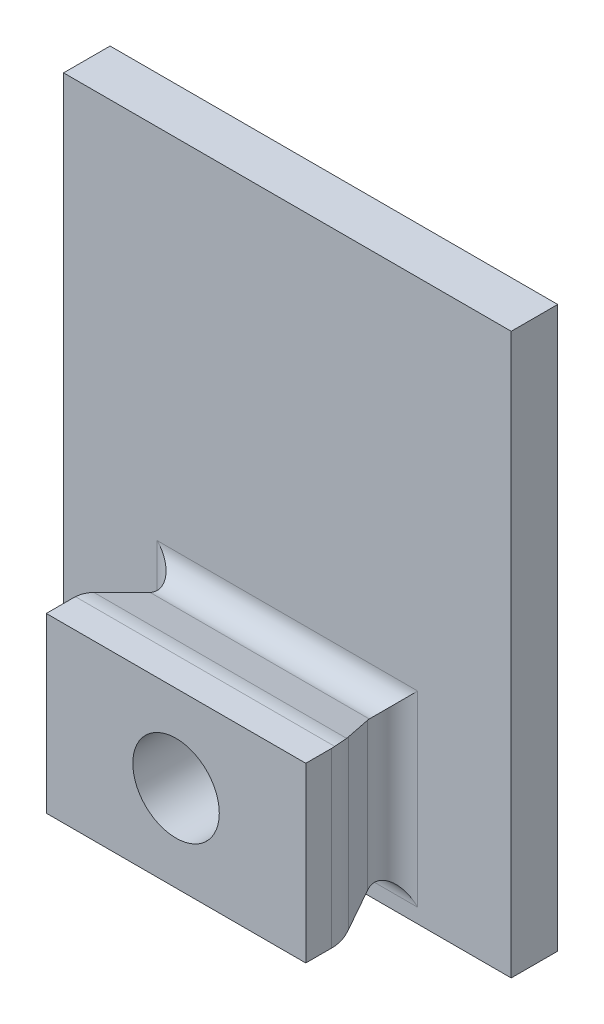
ISO-10303-21;
HEADER;
FILE_DESCRIPTION(('STEP AP214'),'2;1');
FILE_NAME('part.step','',(''),(''),'','','');
FILE_SCHEMA(('AUTOMOTIVE_DESIGN { 1 0 10303 214 1 1 1 1 }'));
ENDSEC;
DATA;
#1=APPLICATION_CONTEXT('core data for automotive mechanical design processes');
#2=APPLICATION_PROTOCOL_DEFINITION('international standard','automotive_design',2000,#1);
#3=PRODUCT_CONTEXT('',#1,'mechanical');
#4=PRODUCT('Part','Part','',(#3));
#5=PRODUCT_RELATED_PRODUCT_CATEGORY('part','',(#4));
#6=PRODUCT_DEFINITION_FORMATION('','',#4);
#7=PRODUCT_DEFINITION_CONTEXT('part definition',#1,'design');
#8=PRODUCT_DEFINITION('design','',#6,#7);
#9=PRODUCT_DEFINITION_SHAPE('','',#8);
#10=(LENGTH_UNIT() NAMED_UNIT(*) SI_UNIT(.MILLI.,.METRE.));
#11=(NAMED_UNIT(*) PLANE_ANGLE_UNIT() SI_UNIT($,.RADIAN.));
#12=(NAMED_UNIT(*) SI_UNIT($,.STERADIAN.) SOLID_ANGLE_UNIT());
#13=UNCERTAINTY_MEASURE_WITH_UNIT(LENGTH_MEASURE(1.E-05),#10,'distance_accuracy_value','');
#14=(GEOMETRIC_REPRESENTATION_CONTEXT(3) GLOBAL_UNCERTAINTY_ASSIGNED_CONTEXT((#13)) GLOBAL_UNIT_ASSIGNED_CONTEXT((#10,
#11,#12)) REPRESENTATION_CONTEXT('',''));
#15=CARTESIAN_POINT('',(0.,0.,0.));
#16=DIRECTION('',(0.,0.,1.));
#17=DIRECTION('',(1.,0.,0.));
#18=AXIS2_PLACEMENT_3D('',#15,#16,#17);
#19=CARTESIAN_POINT('',(-60.,40.,17.));
#20=DIRECTION('',(1.,0.,0.));
#21=DIRECTION('',(0.,1.,0.));
#22=AXIS2_PLACEMENT_3D('',#19,#20,#21);
#23=PLANE('',#22);
#24=DIRECTION('',(0.,0.,-1.));
#25=VECTOR('',#24,1.);
#26=CARTESIAN_POINT('',(-60.,40.,17.));
#27=LINE('',#26,#25);
#28=CARTESIAN_POINT('',(-60.,40.,17.));
#29=VERTEX_POINT('',#28);
#30=CARTESIAN_POINT('',(-60.,40.,5.19968101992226));
#31=VERTEX_POINT('',#30);
#32=EDGE_CURVE('E372',#29,#31,#27,.T.);
#33=ORIENTED_EDGE('',*,*,#32,.T.);
#34=DIRECTION('',(0.,-1.,0.));
#35=VECTOR('',#34,1.);
#36=CARTESIAN_POINT('',(-60.,-40.,5.19968101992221));
#37=LINE('',#36,#35);
#38=CARTESIAN_POINT('',(-60.,-40.,5.19968101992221));
#39=VERTEX_POINT('',#38);
#40=EDGE_CURVE('E359',#31,#39,#37,.T.);
#41=ORIENTED_EDGE('',*,*,#40,.T.);
#42=DIRECTION('',(0.,0.,-1.));
#43=VECTOR('',#42,1.);
#44=CARTESIAN_POINT('',(-60.,-40.,17.));
#45=LINE('',#44,#43);
#46=CARTESIAN_POINT('',(-60.,-40.,17.));
#47=VERTEX_POINT('',#46);
#48=EDGE_CURVE('E376',#47,#39,#45,.T.);
#49=ORIENTED_EDGE('',*,*,#48,.F.);
#50=DIRECTION('',(0.,-1.,0.));
#51=VECTOR('',#50,1.);
#52=CARTESIAN_POINT('',(-60.,40.,17.));
#53=LINE('',#52,#51);
#54=EDGE_CURVE('E235',#29,#47,#53,.T.);
#55=ORIENTED_EDGE('',*,*,#54,.F.);
#56=EDGE_LOOP('',(#33,#41,#49,#55));
#57=FACE_BOUND('',#56,.T.);
#58=ADVANCED_FACE('F43',(#57),#23,.F.);
#59=CARTESIAN_POINT('',(-60.,-40.,17.));
#60=DIRECTION('',(0.,1.,0.));
#61=DIRECTION('',(0.,0.,1.));
#62=AXIS2_PLACEMENT_3D('',#59,#60,#61);
#63=PLANE('',#62);
#64=ORIENTED_EDGE('',*,*,#48,.T.);
#65=CARTESIAN_POINT('',(-35.,-40.,5.19968101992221));
#66=DIRECTION('',(0.,1.,0.));
#67=DIRECTION('',(0.,0.,1.));
#68=AXIS2_PLACEMENT_3D('',#65,#66,#67);
#69=CIRCLE('',#68,25.);
#70=CARTESIAN_POINT('',(-59.9455199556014,-40.,3.55012527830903));
#71=VERTEX_POINT('',#70);
#72=EDGE_CURVE('E389',#39,#71,#69,.F.);
#73=ORIENTED_EDGE('',*,*,#72,.T.);
#74=DIRECTION('',(1.,0.,0.));
#75=VECTOR('',#74,1.);
#76=CARTESIAN_POINT('',(60.,-40.,3.55012527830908));
#77=LINE('',#76,#75);
#78=CARTESIAN_POINT('',(59.9455199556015,-40.,3.55012527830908));
#79=VERTEX_POINT('',#78);
#80=EDGE_CURVE('E386',#71,#79,#77,.T.);
#81=ORIENTED_EDGE('',*,*,#80,.T.);
#82=CARTESIAN_POINT('',(35.,-40.,5.19968101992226));
#83=DIRECTION('',(0.,1.,0.));
#84=DIRECTION('',(0.,0.,1.));
#85=AXIS2_PLACEMENT_3D('',#82,#83,#84);
#86=CIRCLE('',#85,25.);
#87=CARTESIAN_POINT('',(60.,-40.,5.19968101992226));
#88=VERTEX_POINT('',#87);
#89=EDGE_CURVE('E380',#79,#88,#86,.F.);
#90=ORIENTED_EDGE('',*,*,#89,.T.);
#91=DIRECTION('',(0.,0.,-1.));
#92=VECTOR('',#91,1.);
#93=CARTESIAN_POINT('',(60.,-40.,17.));
#94=LINE('',#93,#92);
#95=CARTESIAN_POINT('',(60.,-40.,17.));
#96=VERTEX_POINT('',#95);
#97=EDGE_CURVE('E373',#96,#88,#94,.T.);
#98=ORIENTED_EDGE('',*,*,#97,.F.);
#99=DIRECTION('',(1.,0.,0.));
#100=VECTOR('',#99,1.);
#101=CARTESIAN_POINT('',(-60.,-40.,17.));
#102=LINE('',#101,#100);
#103=EDGE_CURVE('E366',#47,#96,#102,.T.);
#104=ORIENTED_EDGE('',*,*,#103,.F.);
#105=EDGE_LOOP('',(#64,#73,#81,#90,#98,#104));
#106=FACE_BOUND('',#105,.T.);
#107=ADVANCED_FACE('F407',(#106),#63,.F.);
#108=CARTESIAN_POINT('',(60.,40.,17.));
#109=DIRECTION('',(-1.,0.,0.));
#110=DIRECTION('',(0.,-1.,0.));
#111=AXIS2_PLACEMENT_3D('',#108,#109,#110);
#112=PLANE('',#111);
#113=ORIENTED_EDGE('',*,*,#97,.T.);
#114=DIRECTION('',(0.,1.,0.));
#115=VECTOR('',#114,1.);
#116=CARTESIAN_POINT('',(60.,40.,5.19968101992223));
#117=LINE('',#116,#115);
#118=CARTESIAN_POINT('',(60.,40.,5.19968101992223));
#119=VERTEX_POINT('',#118);
#120=EDGE_CURVE('E251',#88,#119,#117,.T.);
#121=ORIENTED_EDGE('',*,*,#120,.T.);
#122=DIRECTION('',(0.,0.,-1.));
#123=VECTOR('',#122,1.);
#124=CARTESIAN_POINT('',(60.,40.,17.));
#125=LINE('',#124,#123);
#126=CARTESIAN_POINT('',(60.,40.,17.));
#127=VERTEX_POINT('',#126);
#128=EDGE_CURVE('E377',#127,#119,#125,.T.);
#129=ORIENTED_EDGE('',*,*,#128,.F.);
#130=DIRECTION('',(0.,1.,0.));
#131=VECTOR('',#130,1.);
#132=CARTESIAN_POINT('',(60.,40.,17.));
#133=LINE('',#132,#131);
#134=EDGE_CURVE('E368',#96,#127,#133,.T.);
#135=ORIENTED_EDGE('',*,*,#134,.F.);
#136=EDGE_LOOP('',(#113,#121,#129,#135));
#137=FACE_BOUND('',#136,.T.);
#138=ADVANCED_FACE('F418',(#137),#112,.F.);
#139=CARTESIAN_POINT('',(-60.,40.,17.));
#140=DIRECTION('',(0.,-1.,0.));
#141=DIRECTION('',(0.,0.,-1.));
#142=AXIS2_PLACEMENT_3D('',#139,#140,#141);
#143=PLANE('',#142);
#144=DIRECTION('',(-1.,0.,0.));
#145=VECTOR('',#144,1.);
#146=CARTESIAN_POINT('',(-60.,40.,3.55012527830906));
#147=LINE('',#146,#145);
#148=CARTESIAN_POINT('',(59.9455199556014,40.,3.55012527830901));
#149=VERTEX_POINT('',#148);
#150=CARTESIAN_POINT('',(-59.9455199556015,40.,3.55012527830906));
#151=VERTEX_POINT('',#150);
#152=EDGE_CURVE('E247',#149,#151,#147,.T.);
#153=ORIENTED_EDGE('',*,*,#152,.T.);
#154=CARTESIAN_POINT('',(-35.,40.,5.19968101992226));
#155=DIRECTION('',(0.,-1.,0.));
#156=DIRECTION('',(0.,0.,-1.));
#157=AXIS2_PLACEMENT_3D('',#154,#155,#156);
#158=CIRCLE('',#157,25.);
#159=EDGE_CURVE('E249',#151,#31,#158,.F.);
#160=ORIENTED_EDGE('',*,*,#159,.T.);
#161=ORIENTED_EDGE('',*,*,#32,.F.);
#162=DIRECTION('',(-1.,0.,0.));
#163=VECTOR('',#162,1.);
#164=CARTESIAN_POINT('',(-60.,40.,17.));
#165=LINE('',#164,#163);
#166=EDGE_CURVE('E370',#127,#29,#165,.T.);
#167=ORIENTED_EDGE('',*,*,#166,.F.);
#168=ORIENTED_EDGE('',*,*,#128,.T.);
#169=CARTESIAN_POINT('',(35.,40.,5.19968101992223));
#170=DIRECTION('',(0.,-1.,0.));
#171=DIRECTION('',(0.,0.,-1.));
#172=AXIS2_PLACEMENT_3D('',#169,#170,#171);
#173=CIRCLE('',#172,25.);
#174=EDGE_CURVE('E245',#119,#149,#173,.F.);
#175=ORIENTED_EDGE('',*,*,#174,.T.);
#176=EDGE_LOOP('',(#153,#160,#161,#167,#168,#175));
#177=FACE_BOUND('',#176,.T.);
#178=ADVANCED_FACE('F426',(#177),#143,.F.);
#179=CARTESIAN_POINT('',(0.,0.,17.));
#180=DIRECTION('',(0.,0.,1.));
#181=DIRECTION('',(1.,0.,0.));
#182=AXIS2_PLACEMENT_3D('',#179,#180,#181);
#183=PLANE('',#182);
#184=CARTESIAN_POINT('',(0.,0.,17.));
#185=DIRECTION('',(0.,0.,1.));
#186=DIRECTION('',(1.,0.,0.));
#187=AXIS2_PLACEMENT_3D('',#184,#185,#186);
#188=CIRCLE('',#187,20.);
#189=CARTESIAN_POINT('',(20.,0.,17.));
#190=VERTEX_POINT('',#189);
#191=EDGE_CURVE('E210',#190,#190,#188,.T.);
#192=ORIENTED_EDGE('',*,*,#191,.F.);
#193=EDGE_LOOP('',(#192));
#194=FACE_BOUND('',#193,.T.);
#195=ORIENTED_EDGE('',*,*,#54,.T.);
#196=ORIENTED_EDGE('',*,*,#103,.T.);
#197=ORIENTED_EDGE('',*,*,#134,.T.);
#198=ORIENTED_EDGE('',*,*,#166,.T.);
#199=EDGE_LOOP('',(#195,#196,#197,#198));
#200=FACE_BOUND('',#199,.T.);
#201=ADVANCED_FACE('F432',(#194,#200),#183,.T.);
#202=CARTESIAN_POINT('',(50.4610492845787,0.,-21.939586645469));
#203=DIRECTION('',(0.917070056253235,0.,-0.39872611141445));
#204=DIRECTION('',(-0.39872611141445,0.,-0.917070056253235));
#205=AXIS2_PLACEMENT_3D('',#202,#203,#204);
#206=PLANE('',#205);
#207=DIRECTION('',(-0.385344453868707,0.256896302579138,-0.886292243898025));
#208=VECTOR('',#207,1.);
#209=CARTESIAN_POINT('',(60.,-40.,0.));
#210=LINE('',#209,#208);
#211=CARTESIAN_POINT('',(57.9267514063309,-38.6178342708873,-4.76847176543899));
#212=VERTEX_POINT('',#211);
#213=CARTESIAN_POINT('',(51.081417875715,-34.05427858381,-20.5127388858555));
#214=VERTEX_POINT('',#213);
#215=EDGE_CURVE('E236',#212,#214,#210,.T.);
#216=ORIENTED_EDGE('',*,*,#215,.T.);
#217=DIRECTION('',(0.,1.,0.));
#218=VECTOR('',#217,1.);
#219=CARTESIAN_POINT('',(51.081417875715,30.,-20.5127388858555));
#220=LINE('',#219,#218);
#221=CARTESIAN_POINT('',(51.081417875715,34.05427858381,-20.5127388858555));
#222=VERTEX_POINT('',#221);
#223=EDGE_CURVE('E310',#214,#222,#220,.T.);
#224=ORIENTED_EDGE('',*,*,#223,.T.);
#225=DIRECTION('',(-0.385344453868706,-0.256896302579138,-0.886292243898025));
#226=VECTOR('',#225,1.);
#227=CARTESIAN_POINT('',(60.,40.,0.));
#228=LINE('',#227,#226);
#229=CARTESIAN_POINT('',(57.9267514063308,38.6178342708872,-4.76847176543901));
#230=VERTEX_POINT('',#229);
#231=EDGE_CURVE('E231',#230,#222,#228,.T.);
#232=ORIENTED_EDGE('',*,*,#231,.F.);
#233=DIRECTION('',(0.,1.,0.));
#234=VECTOR('',#233,1.);
#235=CARTESIAN_POINT('',(57.9267514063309,-40.,-4.76847176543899));
#236=LINE('',#235,#234);
#237=EDGE_CURVE('E253',#230,#212,#236,.F.);
#238=ORIENTED_EDGE('',*,*,#237,.T.);
#239=EDGE_LOOP('',(#216,#224,#232,#238));
#240=FACE_BOUND('',#239,.T.);
#241=ADVANCED_FACE('F434',(#240),#206,.T.);
#242=CARTESIAN_POINT('',(0.,36.8998256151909,-10.6956016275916));
#243=DIRECTION('',(0.,0.960466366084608,-0.278396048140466));
#244=DIRECTION('',(0.,0.278396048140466,0.960466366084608));
#245=AXIS2_PLACEMENT_3D('',#242,#243,#244);
#246=PLANE('',#245);
#247=ORIENTED_EDGE('',*,*,#231,.T.);
#248=CARTESIAN_POINT('',(60.2521184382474,32.8985507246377,-24.5));
#249=DIRECTION('',(0.,0.960466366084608,-0.278396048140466));
#250=DIRECTION('',(0.,-0.278396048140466,-0.960466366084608));
#251=AXIS2_PLACEMENT_3D('',#248,#249,#250);
#252=ELLIPSE('',#251,10.4116087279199,10.);
#253=CARTESIAN_POINT('',(50.6474547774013,33.7054957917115,-21.7160395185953));
#254=VERTEX_POINT('',#253);
#255=EDGE_CURVE('E52',#222,#254,#252,.F.);
#256=ORIENTED_EDGE('',*,*,#255,.T.);
#257=DIRECTION('',(-1.,0.,0.));
#258=VECTOR('',#257,1.);
#259=CARTESIAN_POINT('',(-45.,33.7054957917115,-21.7160395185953));
#260=LINE('',#259,#258);
#261=CARTESIAN_POINT('',(-50.6474547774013,33.7054957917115,-21.7160395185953));
#262=VERTEX_POINT('',#261);
#263=EDGE_CURVE('E255',#254,#262,#260,.T.);
#264=ORIENTED_EDGE('',*,*,#263,.T.);
#265=CARTESIAN_POINT('',(-60.2521184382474,32.8985507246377,-24.5));
#266=DIRECTION('',(0.,0.960466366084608,-0.278396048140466));
#267=DIRECTION('',(0.,0.278396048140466,0.960466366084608));
#268=AXIS2_PLACEMENT_3D('',#265,#266,#267);
#269=ELLIPSE('',#268,10.4116087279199,10.);
#270=CARTESIAN_POINT('',(-51.081417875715,34.05427858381,-20.5127388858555));
#271=VERTEX_POINT('',#270);
#272=EDGE_CURVE('E314',#262,#271,#269,.F.);
#273=ORIENTED_EDGE('',*,*,#272,.T.);
#274=DIRECTION('',(0.385344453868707,-0.256896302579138,-0.886292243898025));
#275=VECTOR('',#274,1.);
#276=CARTESIAN_POINT('',(-60.,40.,0.));
#277=LINE('',#276,#275);
#278=CARTESIAN_POINT('',(-57.9267514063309,38.6178342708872,-4.76847176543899));
#279=VERTEX_POINT('',#278);
#280=EDGE_CURVE('E222',#279,#271,#277,.T.);
#281=ORIENTED_EDGE('',*,*,#280,.F.);
#282=CARTESIAN_POINT('',(-35.,41.507153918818,5.19968101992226));
#283=DIRECTION('',(0.,0.960466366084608,-0.278396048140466));
#284=DIRECTION('',(0.,0.278396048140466,0.960466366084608));
#285=AXIS2_PLACEMENT_3D('',#282,#283,#284);
#286=ELLIPSE('',#285,26.0290218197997,25.);
#287=CARTESIAN_POINT('',(-58.4707744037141,39.0116591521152,-3.40977592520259));
#288=VERTEX_POINT('',#287);
#289=EDGE_CURVE('E243',#279,#288,#286,.T.);
#290=ORIENTED_EDGE('',*,*,#289,.T.);
#291=DIRECTION('',(-1.,0.,0.));
#292=VECTOR('',#291,1.);
#293=CARTESIAN_POINT('',(60.,39.0116591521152,-3.40977592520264));
#294=LINE('',#293,#292);
#295=CARTESIAN_POINT('',(58.4707744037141,39.0116591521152,-3.40977592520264));
#296=VERTEX_POINT('',#295);
#297=EDGE_CURVE('E241',#288,#296,#294,.F.);
#298=ORIENTED_EDGE('',*,*,#297,.T.);
#299=CARTESIAN_POINT('',(35.,41.507153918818,5.19968101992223));
#300=DIRECTION('',(0.,0.960466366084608,-0.278396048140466));
#301=DIRECTION('',(0.,-0.278396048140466,-0.960466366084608));
#302=AXIS2_PLACEMENT_3D('',#299,#300,#301);
#303=ELLIPSE('',#302,26.0290218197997,25.);
#304=EDGE_CURVE('E239',#296,#230,#303,.T.);
#305=ORIENTED_EDGE('',*,*,#304,.T.);
#306=EDGE_LOOP('',(#247,#256,#264,#273,#281,#290,#298,#305));
#307=FACE_BOUND('',#306,.T.);
#308=ADVANCED_FACE('F348',(#307),#246,.T.);
#309=CARTESIAN_POINT('',(0.,-36.8998256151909,-10.6956016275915));
#310=DIRECTION('',(0.,-0.960466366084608,-0.278396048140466));
#311=DIRECTION('',(0.,0.278396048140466,-0.960466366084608));
#312=AXIS2_PLACEMENT_3D('',#309,#310,#311);
#313=PLANE('',#312);
#314=CARTESIAN_POINT('',(-60.2521184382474,-32.8985507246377,-24.5));
#315=DIRECTION('',(0.,-0.960466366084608,-0.278396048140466));
#316=DIRECTION('',(0.,0.278396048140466,-0.960466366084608));
#317=AXIS2_PLACEMENT_3D('',#314,#315,#316);
#318=ELLIPSE('',#317,10.4116087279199,10.);
#319=CARTESIAN_POINT('',(-51.081417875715,-34.05427858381,-20.5127388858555));
#320=VERTEX_POINT('',#319);
#321=CARTESIAN_POINT('',(-50.6474547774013,-33.7054957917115,-21.7160395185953));
#322=VERTEX_POINT('',#321);
#323=EDGE_CURVE('E312',#320,#322,#318,.F.);
#324=ORIENTED_EDGE('',*,*,#323,.T.);
#325=DIRECTION('',(1.,0.,0.));
#326=VECTOR('',#325,1.);
#327=CARTESIAN_POINT('',(45.,-33.7054957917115,-21.7160395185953));
#328=LINE('',#327,#326);
#329=CARTESIAN_POINT('',(50.6474547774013,-33.7054957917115,-21.7160395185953));
#330=VERTEX_POINT('',#329);
#331=EDGE_CURVE('E59',#322,#330,#328,.T.);
#332=ORIENTED_EDGE('',*,*,#331,.T.);
#333=CARTESIAN_POINT('',(60.2521184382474,-32.8985507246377,-24.5));
#334=DIRECTION('',(0.,-0.960466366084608,-0.278396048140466));
#335=DIRECTION('',(0.,-0.278396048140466,0.960466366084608));
#336=AXIS2_PLACEMENT_3D('',#333,#334,#335);
#337=ELLIPSE('',#336,10.4116087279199,10.);
#338=EDGE_CURVE('E12',#330,#214,#337,.F.);
#339=ORIENTED_EDGE('',*,*,#338,.T.);
#340=ORIENTED_EDGE('',*,*,#215,.F.);
#341=CARTESIAN_POINT('',(35.,-41.507153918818,5.19968101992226));
#342=DIRECTION('',(0.,-0.960466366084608,-0.278396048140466));
#343=DIRECTION('',(0.,-0.278396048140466,0.960466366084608));
#344=AXIS2_PLACEMENT_3D('',#341,#342,#343);
#345=ELLIPSE('',#344,26.0290218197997,25.);
#346=CARTESIAN_POINT('',(58.4707744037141,-39.0116591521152,-3.40977592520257));
#347=VERTEX_POINT('',#346);
#348=EDGE_CURVE('E390',#212,#347,#345,.T.);
#349=ORIENTED_EDGE('',*,*,#348,.T.);
#350=DIRECTION('',(1.,0.,0.));
#351=VECTOR('',#350,1.);
#352=CARTESIAN_POINT('',(-60.,-39.0116591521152,-3.40977592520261));
#353=LINE('',#352,#351);
#354=CARTESIAN_POINT('',(-58.4707744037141,-39.0116591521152,-3.40977592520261));
#355=VERTEX_POINT('',#354);
#356=EDGE_CURVE('E395',#347,#355,#353,.F.);
#357=ORIENTED_EDGE('',*,*,#356,.T.);
#358=CARTESIAN_POINT('',(-35.,-41.507153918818,5.19968101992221));
#359=DIRECTION('',(0.,-0.960466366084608,-0.278396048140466));
#360=DIRECTION('',(0.,0.278396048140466,-0.960466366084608));
#361=AXIS2_PLACEMENT_3D('',#358,#359,#360);
#362=ELLIPSE('',#361,26.0290218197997,25.);
#363=CARTESIAN_POINT('',(-57.9267514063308,-38.6178342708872,-4.76847176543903));
#364=VERTEX_POINT('',#363);
#365=EDGE_CURVE('E397',#355,#364,#362,.T.);
#366=ORIENTED_EDGE('',*,*,#365,.T.);
#367=DIRECTION('',(0.385344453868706,0.256896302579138,-0.886292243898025));
#368=VECTOR('',#367,1.);
#369=CARTESIAN_POINT('',(-60.,-40.,0.));
#370=LINE('',#369,#368);
#371=EDGE_CURVE('E355',#364,#320,#370,.T.);
#372=ORIENTED_EDGE('',*,*,#371,.T.);
#373=EDGE_LOOP('',(#324,#332,#339,#340,#349,#357,#366,#372));
#374=FACE_BOUND('',#373,.T.);
#375=ADVANCED_FACE('F508',(#374),#313,.T.);
#376=CARTESIAN_POINT('',(-50.4610492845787,0.,-21.939586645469));
#377=DIRECTION('',(-0.917070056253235,0.,-0.39872611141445));
#378=DIRECTION('',(-0.39872611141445,0.,0.917070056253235));
#379=AXIS2_PLACEMENT_3D('',#376,#377,#378);
#380=PLANE('',#379);
#381=ORIENTED_EDGE('',*,*,#280,.T.);
#382=DIRECTION('',(0.,-1.,0.));
#383=VECTOR('',#382,1.);
#384=CARTESIAN_POINT('',(-51.081417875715,-30.,-20.5127388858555));
#385=LINE('',#384,#383);
#386=EDGE_CURVE('E307',#271,#320,#385,.T.);
#387=ORIENTED_EDGE('',*,*,#386,.T.);
#388=ORIENTED_EDGE('',*,*,#371,.F.);
#389=DIRECTION('',(0.,-1.,0.));
#390=VECTOR('',#389,1.);
#391=CARTESIAN_POINT('',(-57.9267514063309,40.,-4.76847176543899));
#392=LINE('',#391,#390);
#393=EDGE_CURVE('E237',#364,#279,#392,.F.);
#394=ORIENTED_EDGE('',*,*,#393,.T.);
#395=EDGE_LOOP('',(#381,#387,#388,#394));
#396=FACE_BOUND('',#395,.T.);
#397=ADVANCED_FACE('F351',(#396),#380,.T.);
#398=CARTESIAN_POINT('',(103.5,-50.,-56.));
#399=DIRECTION('',(1.,0.,0.));
#400=DIRECTION('',(0.,0.,-1.));
#401=AXIS2_PLACEMENT_3D('',#398,#399,#400);
#402=PLANE('',#401);
#403=DIRECTION('',(0.,1.,0.));
#404=VECTOR('',#403,1.);
#405=CARTESIAN_POINT('',(103.5,-50.,-34.5));
#406=LINE('',#405,#404);
#407=CARTESIAN_POINT('',(103.5,-50.,-34.5));
#408=VERTEX_POINT('',#407);
#409=CARTESIAN_POINT('',(103.5,209.,-34.5));
#410=VERTEX_POINT('',#409);
#411=EDGE_CURVE('E215',#408,#410,#406,.T.);
#412=ORIENTED_EDGE('',*,*,#411,.F.);
#413=DIRECTION('',(0.,0.,1.));
#414=VECTOR('',#413,1.);
#415=CARTESIAN_POINT('',(103.5,-50.,-56.));
#416=LINE('',#415,#414);
#417=CARTESIAN_POINT('',(103.5,-50.,-56.));
#418=VERTEX_POINT('',#417);
#419=EDGE_CURVE('E203',#418,#408,#416,.T.);
#420=ORIENTED_EDGE('',*,*,#419,.F.);
#421=DIRECTION('',(0.,1.,0.));
#422=VECTOR('',#421,1.);
#423=CARTESIAN_POINT('',(103.5,-50.,-56.));
#424=LINE('',#423,#422);
#425=CARTESIAN_POINT('',(103.5,209.,-56.));
#426=VERTEX_POINT('',#425);
#427=EDGE_CURVE('E197',#418,#426,#424,.T.);
#428=ORIENTED_EDGE('',*,*,#427,.T.);
#429=DIRECTION('',(0.,0.,1.));
#430=VECTOR('',#429,1.);
#431=CARTESIAN_POINT('',(103.5,209.,-56.));
#432=LINE('',#431,#430);
#433=EDGE_CURVE('E179',#426,#410,#432,.T.);
#434=ORIENTED_EDGE('',*,*,#433,.T.);
#435=EDGE_LOOP('',(#412,#420,#428,#434));
#436=FACE_BOUND('',#435,.T.);
#437=ADVANCED_FACE('F202',(#436),#402,.T.);
#438=CARTESIAN_POINT('',(103.5,-50.,-56.));
#439=DIRECTION('',(0.,-1.,0.));
#440=DIRECTION('',(1.,0.,0.));
#441=AXIS2_PLACEMENT_3D('',#438,#439,#440);
#442=PLANE('',#441);
#443=DIRECTION('',(1.,0.,0.));
#444=VECTOR('',#443,1.);
#445=CARTESIAN_POINT('',(103.5,-50.,-34.5));
#446=LINE('',#445,#444);
#447=CARTESIAN_POINT('',(-103.5,-50.,-34.5));
#448=VERTEX_POINT('',#447);
#449=EDGE_CURVE('E204',#448,#408,#446,.T.);
#450=ORIENTED_EDGE('',*,*,#449,.F.);
#451=DIRECTION('',(0.,0.,1.));
#452=VECTOR('',#451,1.);
#453=CARTESIAN_POINT('',(-103.5,-50.,-56.));
#454=LINE('',#453,#452);
#455=CARTESIAN_POINT('',(-103.5,-50.,-56.));
#456=VERTEX_POINT('',#455);
#457=EDGE_CURVE('E223',#456,#448,#454,.T.);
#458=ORIENTED_EDGE('',*,*,#457,.F.);
#459=DIRECTION('',(1.,0.,0.));
#460=VECTOR('',#459,1.);
#461=CARTESIAN_POINT('',(103.5,-50.,-56.));
#462=LINE('',#461,#460);
#463=EDGE_CURVE('E190',#456,#418,#462,.T.);
#464=ORIENTED_EDGE('',*,*,#463,.T.);
#465=ORIENTED_EDGE('',*,*,#419,.T.);
#466=EDGE_LOOP('',(#450,#458,#464,#465));
#467=FACE_BOUND('',#466,.T.);
#468=ADVANCED_FACE('F607',(#467),#442,.T.);
#469=CARTESIAN_POINT('',(-103.5,-50.,-56.));
#470=DIRECTION('',(-1.,0.,0.));
#471=DIRECTION('',(0.,-1.,0.));
#472=AXIS2_PLACEMENT_3D('',#469,#470,#471);
#473=PLANE('',#472);
#474=DIRECTION('',(0.,-1.,0.));
#475=VECTOR('',#474,1.);
#476=CARTESIAN_POINT('',(-103.5,-50.,-34.5));
#477=LINE('',#476,#475);
#478=CARTESIAN_POINT('',(-103.5,209.,-34.5));
#479=VERTEX_POINT('',#478);
#480=EDGE_CURVE('E207',#479,#448,#477,.T.);
#481=ORIENTED_EDGE('',*,*,#480,.F.);
#482=DIRECTION('',(0.,0.,1.));
#483=VECTOR('',#482,1.);
#484=CARTESIAN_POINT('',(-103.5,209.,-56.));
#485=LINE('',#484,#483);
#486=CARTESIAN_POINT('',(-103.5,209.,-56.));
#487=VERTEX_POINT('',#486);
#488=EDGE_CURVE('E189',#487,#479,#485,.T.);
#489=ORIENTED_EDGE('',*,*,#488,.F.);
#490=DIRECTION('',(0.,-1.,0.));
#491=VECTOR('',#490,1.);
#492=CARTESIAN_POINT('',(-103.5,-50.,-56.));
#493=LINE('',#492,#491);
#494=EDGE_CURVE('E200',#487,#456,#493,.T.);
#495=ORIENTED_EDGE('',*,*,#494,.T.);
#496=ORIENTED_EDGE('',*,*,#457,.T.);
#497=EDGE_LOOP('',(#481,#489,#495,#496));
#498=FACE_BOUND('',#497,.T.);
#499=ADVANCED_FACE('F598',(#498),#473,.T.);
#500=CARTESIAN_POINT('',(103.5,209.,-56.));
#501=DIRECTION('',(0.,1.,0.));
#502=DIRECTION('',(0.,0.,1.));
#503=AXIS2_PLACEMENT_3D('',#500,#501,#502);
#504=PLANE('',#503);
#505=DIRECTION('',(-1.,0.,0.));
#506=VECTOR('',#505,1.);
#507=CARTESIAN_POINT('',(103.5,209.,-34.5));
#508=LINE('',#507,#506);
#509=EDGE_CURVE('E184',#410,#479,#508,.T.);
#510=ORIENTED_EDGE('',*,*,#509,.F.);
#511=ORIENTED_EDGE('',*,*,#433,.F.);
#512=DIRECTION('',(-1.,0.,0.));
#513=VECTOR('',#512,1.);
#514=CARTESIAN_POINT('',(103.5,209.,-56.));
#515=LINE('',#514,#513);
#516=EDGE_CURVE('E182',#426,#487,#515,.T.);
#517=ORIENTED_EDGE('',*,*,#516,.T.);
#518=ORIENTED_EDGE('',*,*,#488,.T.);
#519=EDGE_LOOP('',(#510,#511,#517,#518));
#520=FACE_BOUND('',#519,.T.);
#521=ADVANCED_FACE('F181',(#520),#504,.T.);
#522=CARTESIAN_POINT('',(0.,0.,-56.));
#523=DIRECTION('',(0.,0.,1.));
#524=DIRECTION('',(1.,0.,0.));
#525=AXIS2_PLACEMENT_3D('',#522,#523,#524);
#526=PLANE('',#525);
#527=CARTESIAN_POINT('',(0.,0.,-56.));
#528=DIRECTION('',(0.,0.,1.));
#529=DIRECTION('',(1.,0.,0.));
#530=AXIS2_PLACEMENT_3D('',#527,#528,#529);
#531=CIRCLE('',#530,20.);
#532=CARTESIAN_POINT('',(20.,0.,-56.));
#533=VERTEX_POINT('',#532);
#534=EDGE_CURVE('E217',#533,#533,#531,.T.);
#535=ORIENTED_EDGE('',*,*,#534,.T.);
#536=EDGE_LOOP('',(#535));
#537=FACE_BOUND('',#536,.T.);
#538=ORIENTED_EDGE('',*,*,#427,.F.);
#539=ORIENTED_EDGE('',*,*,#463,.F.);
#540=ORIENTED_EDGE('',*,*,#494,.F.);
#541=ORIENTED_EDGE('',*,*,#516,.F.);
#542=EDGE_LOOP('',(#538,#539,#540,#541));
#543=FACE_BOUND('',#542,.T.);
#544=ADVANCED_FACE('F195',(#537,#543),#526,.F.);
#545=CARTESIAN_POINT('',(0.,0.,-34.5));
#546=DIRECTION('',(0.,0.,1.));
#547=DIRECTION('',(1.,0.,0.));
#548=AXIS2_PLACEMENT_3D('',#545,#546,#547);
#549=PLANE('',#548);
#550=DIRECTION('',(0.,-1.,0.));
#551=VECTOR('',#550,1.);
#552=CARTESIAN_POINT('',(-60.2521184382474,30.,-34.5));
#553=LINE('',#552,#551);
#554=CARTESIAN_POINT('',(-60.2521184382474,-43.3101594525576,-34.5));
#555=VERTEX_POINT('',#554);
#556=CARTESIAN_POINT('',(-60.2521184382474,43.3101594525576,-34.5));
#557=VERTEX_POINT('',#556);
#558=EDGE_CURVE('E302',#555,#557,#553,.F.);
#559=ORIENTED_EDGE('',*,*,#558,.T.);
#560=DIRECTION('',(-1.,0.,0.));
#561=VECTOR('',#560,1.);
#562=CARTESIAN_POINT('',(45.,43.3101594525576,-34.5));
#563=LINE('',#562,#561);
#564=CARTESIAN_POINT('',(60.2521184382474,43.3101594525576,-34.5));
#565=VERTEX_POINT('',#564);
#566=EDGE_CURVE('E304',#557,#565,#563,.F.);
#567=ORIENTED_EDGE('',*,*,#566,.T.);
#568=DIRECTION('',(0.,1.,0.));
#569=VECTOR('',#568,1.);
#570=CARTESIAN_POINT('',(60.2521184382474,-30.,-34.5));
#571=LINE('',#570,#569);
#572=CARTESIAN_POINT('',(60.2521184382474,-43.3101594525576,-34.5));
#573=VERTEX_POINT('',#572);
#574=EDGE_CURVE('E298',#565,#573,#571,.F.);
#575=ORIENTED_EDGE('',*,*,#574,.T.);
#576=DIRECTION('',(1.,0.,0.));
#577=VECTOR('',#576,1.);
#578=CARTESIAN_POINT('',(-45.,-43.3101594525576,-34.5));
#579=LINE('',#578,#577);
#580=EDGE_CURVE('E300',#573,#555,#579,.F.);
#581=ORIENTED_EDGE('',*,*,#580,.T.);
#582=EDGE_LOOP('',(#559,#567,#575,#581));
#583=FACE_BOUND('',#582,.T.);
#584=ORIENTED_EDGE('',*,*,#411,.T.);
#585=ORIENTED_EDGE('',*,*,#509,.T.);
#586=ORIENTED_EDGE('',*,*,#480,.T.);
#587=ORIENTED_EDGE('',*,*,#449,.T.);
#588=EDGE_LOOP('',(#584,#585,#586,#587));
#589=FACE_BOUND('',#588,.T.);
#590=ADVANCED_FACE('F336',(#583,#589),#549,.T.);
#591=CARTESIAN_POINT('',(0.,0.,-56.));
#592=DIRECTION('',(0.,0.,1.));
#593=DIRECTION('',(1.,0.,0.));
#594=AXIS2_PLACEMENT_3D('',#591,#592,#593);
#595=CYLINDRICAL_SURFACE('',#594,20.);
#596=ORIENTED_EDGE('',*,*,#534,.F.);
#597=EDGE_LOOP('',(#596));
#598=FACE_BOUND('',#597,.T.);
#599=ORIENTED_EDGE('',*,*,#191,.T.);
#600=EDGE_LOOP('',(#599));
#601=FACE_BOUND('',#600,.T.);
#602=ADVANCED_FACE('F471',(#598,#601),#595,.F.);
#603=CARTESIAN_POINT('',(-60.,15.,3.55012527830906));
#604=DIRECTION('',(1.,0.,0.));
#605=DIRECTION('',(0.,0.,-1.));
#606=AXIS2_PLACEMENT_3D('',#603,#604,#605);
#607=CYLINDRICAL_SURFACE('',#606,25.);
#608=CARTESIAN_POINT('',(58.4707744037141,39.0116591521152,-3.40977592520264));
#609=CARTESIAN_POINT('',(58.5713153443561,39.0911055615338,-3.13568099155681));
#610=CARTESIAN_POINT('',(58.6674379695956,39.1662776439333,-2.85878153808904));
#611=CARTESIAN_POINT('',(58.8504987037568,39.3076753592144,-2.29967421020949));
#612=CARTESIAN_POINT('',(58.9374356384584,39.373899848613,-2.01746566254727));
#613=CARTESIAN_POINT('',(59.1823172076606,39.5573337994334,-1.16894931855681));
#614=CARTESIAN_POINT('',(59.3262930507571,39.6608572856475,-0.595425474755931));
#615=CARTESIAN_POINT('',(59.5120289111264,39.7863324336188,0.275373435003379));
#616=CARTESIAN_POINT('',(59.5689127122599,39.8231943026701,0.567461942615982));
#617=CARTESIAN_POINT('',(59.6723747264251,39.8867145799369,1.1545957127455));
#618=CARTESIAN_POINT('',(59.7189529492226,39.9133729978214,1.44964097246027));
#619=CARTESIAN_POINT('',(59.8019652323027,39.9564351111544,2.04474677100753));
#620=CARTESIAN_POINT('',(59.8382994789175,39.9727397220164,2.34482836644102));
#621=CARTESIAN_POINT('',(59.9000984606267,39.9945284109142,2.9465232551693));
#622=CARTESIAN_POINT('',(59.9255623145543,40.0000116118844,3.24813667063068));
#623=CARTESIAN_POINT('',(59.9455199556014,40.,3.55012527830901));
#624=B_SPLINE_CURVE_WITH_KNOTS('',3,(#608,#609,#610,#611,#612,#613,#614,#615,#616,#617,#618,
#619,#620,#621,#622,#623),.UNSPECIFIED.,.F.,.F.,(4,2,2,2,2,2,2,4),(0.,0.907523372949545,
1.81516261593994,3.61285516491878,4.51212502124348,5.41139402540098,6.31914413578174,
7.22696781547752),.UNSPECIFIED.);
#625=EDGE_CURVE('E293',#296,#149,#624,.T.);
#626=ORIENTED_EDGE('',*,*,#625,.F.);
#627=ORIENTED_EDGE('',*,*,#297,.F.);
#628=CARTESIAN_POINT('',(-58.4707744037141,39.0116591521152,-3.40977592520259));
#629=CARTESIAN_POINT('',(-58.5713153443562,39.0911055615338,-3.13568099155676));
#630=CARTESIAN_POINT('',(-58.6674379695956,39.1662776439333,-2.85878153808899));
#631=CARTESIAN_POINT('',(-58.8504987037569,39.3076753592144,-2.29967421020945));
#632=CARTESIAN_POINT('',(-58.9374356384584,39.373899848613,-2.01746566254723));
#633=CARTESIAN_POINT('',(-59.1823172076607,39.5573337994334,-1.16894931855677));
#634=CARTESIAN_POINT('',(-59.3262930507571,39.6608572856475,-0.595425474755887));
#635=CARTESIAN_POINT('',(-59.5120289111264,39.7863324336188,0.275373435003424));
#636=CARTESIAN_POINT('',(-59.5689127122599,39.8231943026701,0.567461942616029));
#637=CARTESIAN_POINT('',(-59.6723747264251,39.8867145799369,1.15459571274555));
#638=CARTESIAN_POINT('',(-59.7189529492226,39.9133729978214,1.44964097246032));
#639=CARTESIAN_POINT('',(-59.8019652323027,39.9564351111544,2.04474677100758));
#640=CARTESIAN_POINT('',(-59.8382994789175,39.9727397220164,2.34482836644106));
#641=CARTESIAN_POINT('',(-59.9000984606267,39.9945284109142,2.94652325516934));
#642=CARTESIAN_POINT('',(-59.9255623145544,40.0000116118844,3.24813667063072));
#643=CARTESIAN_POINT('',(-59.9455199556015,40.,3.55012527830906));
#644=B_SPLINE_CURVE_WITH_KNOTS('',3,(#628,#629,#630,#631,#632,#633,#634,#635,#636,#637,#638,
#639,#640,#641,#642,#643),.UNSPECIFIED.,.F.,.F.,(4,2,2,2,2,2,2,4),(0.,0.907523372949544,
1.81516261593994,3.61285516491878,4.51212502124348,5.41139402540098,6.31914413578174,
7.22696781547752),.UNSPECIFIED.);
#645=EDGE_CURVE('E287',#151,#288,#644,.F.);
#646=ORIENTED_EDGE('',*,*,#645,.F.);
#647=ORIENTED_EDGE('',*,*,#152,.F.);
#648=EDGE_LOOP('',(#626,#627,#646,#647));
#649=FACE_BOUND('',#648,.T.);
#650=ADVANCED_FACE('F281',(#649),#607,.T.);
#651=CARTESIAN_POINT('',(-35.,40.,5.19968101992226));
#652=DIRECTION('',(0.,1.,0.));
#653=DIRECTION('',(0.,0.,1.));
#654=AXIS2_PLACEMENT_3D('',#651,#652,#653);
#655=CYLINDRICAL_SURFACE('',#654,25.);
#656=ORIENTED_EDGE('',*,*,#393,.F.);
#657=ORIENTED_EDGE('',*,*,#365,.F.);
#658=CARTESIAN_POINT('',(-58.4707744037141,-39.0116591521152,-3.40977592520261));
#659=CARTESIAN_POINT('',(-58.5713153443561,-39.0911055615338,-3.13568099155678));
#660=CARTESIAN_POINT('',(-58.6674379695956,-39.1662776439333,-2.85878153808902));
#661=CARTESIAN_POINT('',(-58.8504987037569,-39.3076753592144,-2.29967421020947));
#662=CARTESIAN_POINT('',(-58.9374356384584,-39.373899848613,-2.01746566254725));
#663=CARTESIAN_POINT('',(-59.1823172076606,-39.5573337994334,-1.1689493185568));
#664=CARTESIAN_POINT('',(-59.3262930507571,-39.6608572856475,-0.595425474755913));
#665=CARTESIAN_POINT('',(-59.5120289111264,-39.7863324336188,0.275373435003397));
#666=CARTESIAN_POINT('',(-59.5689127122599,-39.8231943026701,0.567461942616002));
#667=CARTESIAN_POINT('',(-59.6723747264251,-39.8867145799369,1.15459571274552));
#668=CARTESIAN_POINT('',(-59.7189529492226,-39.9133729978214,1.44964097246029));
#669=CARTESIAN_POINT('',(-59.8019652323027,-39.9564351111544,2.04474677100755));
#670=CARTESIAN_POINT('',(-59.8382994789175,-39.9727397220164,2.34482836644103));
#671=CARTESIAN_POINT('',(-59.9000984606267,-39.9945284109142,2.94652325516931));
#672=CARTESIAN_POINT('',(-59.9255623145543,-40.0000116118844,3.24813667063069));
#673=CARTESIAN_POINT('',(-59.9455199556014,-40.,3.55012527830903));
#674=B_SPLINE_CURVE_WITH_KNOTS('',3,(#658,#659,#660,#661,#662,#663,#664,#665,#666,#667,#668,
#669,#670,#671,#672,#673),.UNSPECIFIED.,.F.,.F.,(4,2,2,2,2,2,2,4),(0.,0.907523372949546,
1.81516261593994,3.61285516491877,4.51212502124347,5.41139402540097,6.31914413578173,
7.22696781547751),.UNSPECIFIED.);
#675=EDGE_CURVE('E263',#71,#355,#674,.F.);
#676=ORIENTED_EDGE('',*,*,#675,.F.);
#677=ORIENTED_EDGE('',*,*,#72,.F.);
#678=ORIENTED_EDGE('',*,*,#40,.F.);
#679=ORIENTED_EDGE('',*,*,#159,.F.);
#680=ORIENTED_EDGE('',*,*,#645,.T.);
#681=ORIENTED_EDGE('',*,*,#289,.F.);
#682=EDGE_LOOP('',(#656,#657,#676,#677,#678,#679,#680,#681));
#683=FACE_BOUND('',#682,.T.);
#684=ADVANCED_FACE('F276',(#683),#655,.T.);
#685=CARTESIAN_POINT('',(35.,40.,5.19968101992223));
#686=DIRECTION('',(0.,-1.,0.));
#687=DIRECTION('',(0.,0.,-1.));
#688=AXIS2_PLACEMENT_3D('',#685,#686,#687);
#689=CYLINDRICAL_SURFACE('',#688,25.);
#690=ORIENTED_EDGE('',*,*,#120,.F.);
#691=ORIENTED_EDGE('',*,*,#89,.F.);
#692=CARTESIAN_POINT('',(59.9455199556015,-40.,3.55012527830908));
#693=CARTESIAN_POINT('',(59.9255623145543,-40.0000116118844,3.24813667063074));
#694=CARTESIAN_POINT('',(59.9000984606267,-39.9945284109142,2.94652325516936));
#695=CARTESIAN_POINT('',(59.8382994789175,-39.9727397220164,2.34482836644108));
#696=CARTESIAN_POINT('',(59.8019652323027,-39.9564351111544,2.0447467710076));
#697=CARTESIAN_POINT('',(59.7189529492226,-39.9133729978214,1.44964097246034));
#698=CARTESIAN_POINT('',(59.6723747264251,-39.8867145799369,1.15459571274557));
#699=CARTESIAN_POINT('',(59.5689127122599,-39.8231943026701,0.567461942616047));
#700=CARTESIAN_POINT('',(59.5120289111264,-39.7863324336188,0.275373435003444));
#701=CARTESIAN_POINT('',(59.3262930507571,-39.6608572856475,-0.595425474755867));
#702=CARTESIAN_POINT('',(59.1823172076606,-39.5573337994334,-1.16894931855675));
#703=CARTESIAN_POINT('',(58.9374356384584,-39.373899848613,-2.01746566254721));
#704=CARTESIAN_POINT('',(58.8504987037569,-39.3076753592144,-2.29967421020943));
#705=CARTESIAN_POINT('',(58.6674379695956,-39.1662776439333,-2.85878153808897));
#706=CARTESIAN_POINT('',(58.5713153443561,-39.0911055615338,-3.13568099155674));
#707=CARTESIAN_POINT('',(58.4707744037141,-39.0116591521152,-3.40977592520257));
#708=B_SPLINE_CURVE_WITH_KNOTS('',3,(#692,#693,#694,#695,#696,#697,#698,#699,#700,#701,#702,
#703,#704,#705,#706,#707),.UNSPECIFIED.,.F.,.F.,(4,2,2,2,2,2,2,4),(0.,0.907823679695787,
1.81557379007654,2.71484279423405,3.61411265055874,5.41180519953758,6.31944444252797,
7.22696781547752),.UNSPECIFIED.);
#709=EDGE_CURVE('E256',#347,#79,#708,.F.);
#710=ORIENTED_EDGE('',*,*,#709,.F.);
#711=ORIENTED_EDGE('',*,*,#348,.F.);
#712=ORIENTED_EDGE('',*,*,#237,.F.);
#713=ORIENTED_EDGE('',*,*,#304,.F.);
#714=ORIENTED_EDGE('',*,*,#625,.T.);
#715=ORIENTED_EDGE('',*,*,#174,.F.);
#716=EDGE_LOOP('',(#690,#691,#710,#711,#712,#713,#714,#715));
#717=FACE_BOUND('',#716,.T.);
#718=ADVANCED_FACE('F269',(#717),#689,.T.);
#719=CARTESIAN_POINT('',(-60.,-15.,3.55012527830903));
#720=DIRECTION('',(-1.,0.,0.));
#721=DIRECTION('',(0.,0.,1.));
#722=AXIS2_PLACEMENT_3D('',#719,#720,#721);
#723=CYLINDRICAL_SURFACE('',#722,25.);
#724=ORIENTED_EDGE('',*,*,#675,.T.);
#725=ORIENTED_EDGE('',*,*,#356,.F.);
#726=ORIENTED_EDGE('',*,*,#709,.T.);
#727=ORIENTED_EDGE('',*,*,#80,.F.);
#728=EDGE_LOOP('',(#724,#725,#726,#727));
#729=FACE_BOUND('',#728,.T.);
#730=ADVANCED_FACE('F272',(#729),#723,.T.);
#731=CARTESIAN_POINT('',(0.,-43.3101594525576,-24.5));
#732=DIRECTION('',(-1.,0.,0.));
#733=DIRECTION('',(0.,-1.,0.));
#734=AXIS2_PLACEMENT_3D('',#731,#732,#733);
#735=CYLINDRICAL_SURFACE('',#734,10.);
#736=CARTESIAN_POINT('',(-60.2521184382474,-43.3101594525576,-24.5));
#737=DIRECTION('',(-0.707106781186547,0.707106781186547,0.));
#738=DIRECTION('',(-0.707106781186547,-0.707106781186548,0.));
#739=AXIS2_PLACEMENT_3D('',#736,#737,#738);
#740=ELLIPSE('',#739,14.142135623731,10.);
#741=EDGE_CURVE('E322',#555,#322,#740,.F.);
#742=ORIENTED_EDGE('',*,*,#741,.F.);
#743=ORIENTED_EDGE('',*,*,#580,.F.);
#744=CARTESIAN_POINT('',(60.2521184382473,-43.3101594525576,-24.5));
#745=DIRECTION('',(-0.707106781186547,-0.707106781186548,0.));
#746=DIRECTION('',(0.707106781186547,-0.707106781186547,0.));
#747=AXIS2_PLACEMENT_3D('',#744,#745,#746);
#748=ELLIPSE('',#747,14.1421356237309,10.);
#749=EDGE_CURVE('E47',#330,#573,#748,.T.);
#750=ORIENTED_EDGE('',*,*,#749,.F.);
#751=ORIENTED_EDGE('',*,*,#331,.F.);
#752=EDGE_LOOP('',(#742,#743,#750,#751));
#753=FACE_BOUND('',#752,.T.);
#754=ADVANCED_FACE('F45',(#753),#735,.F.);
#755=CARTESIAN_POINT('',(60.2521184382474,0.,-24.5));
#756=DIRECTION('',(0.,-1.,0.));
#757=DIRECTION('',(0.,0.,-1.));
#758=AXIS2_PLACEMENT_3D('',#755,#756,#757);
#759=CYLINDRICAL_SURFACE('',#758,10.);
#760=ORIENTED_EDGE('',*,*,#749,.T.);
#761=ORIENTED_EDGE('',*,*,#574,.F.);
#762=CARTESIAN_POINT('',(60.2521184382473,43.3101594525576,-24.5));
#763=DIRECTION('',(0.707106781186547,-0.707106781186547,0.));
#764=DIRECTION('',(-0.707106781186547,-0.707106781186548,0.));
#765=AXIS2_PLACEMENT_3D('',#762,#763,#764);
#766=ELLIPSE('',#765,14.142135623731,10.);
#767=EDGE_CURVE('E321',#254,#565,#766,.T.);
#768=ORIENTED_EDGE('',*,*,#767,.F.);
#769=ORIENTED_EDGE('',*,*,#255,.F.);
#770=ORIENTED_EDGE('',*,*,#223,.F.);
#771=ORIENTED_EDGE('',*,*,#338,.F.);
#772=EDGE_LOOP('',(#760,#761,#768,#769,#770,#771));
#773=FACE_BOUND('',#772,.T.);
#774=ADVANCED_FACE('F331',(#773),#759,.F.);
#775=CARTESIAN_POINT('',(-60.2521184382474,0.,-24.5));
#776=DIRECTION('',(0.,1.,0.));
#777=DIRECTION('',(0.,0.,1.));
#778=AXIS2_PLACEMENT_3D('',#775,#776,#777);
#779=CYLINDRICAL_SURFACE('',#778,10.);
#780=ORIENTED_EDGE('',*,*,#386,.F.);
#781=ORIENTED_EDGE('',*,*,#272,.F.);
#782=CARTESIAN_POINT('',(-60.2521184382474,43.3101594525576,-24.5));
#783=DIRECTION('',(0.707106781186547,0.707106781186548,0.));
#784=DIRECTION('',(-0.707106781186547,0.707106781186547,0.));
#785=AXIS2_PLACEMENT_3D('',#782,#783,#784);
#786=ELLIPSE('',#785,14.1421356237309,10.);
#787=EDGE_CURVE('E318',#557,#262,#786,.F.);
#788=ORIENTED_EDGE('',*,*,#787,.F.);
#789=ORIENTED_EDGE('',*,*,#558,.F.);
#790=ORIENTED_EDGE('',*,*,#741,.T.);
#791=ORIENTED_EDGE('',*,*,#323,.F.);
#792=EDGE_LOOP('',(#780,#781,#788,#789,#790,#791));
#793=FACE_BOUND('',#792,.T.);
#794=ADVANCED_FACE('F344',(#793),#779,.F.);
#795=CARTESIAN_POINT('',(0.,43.3101594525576,-24.5));
#796=DIRECTION('',(1.,0.,0.));
#797=DIRECTION('',(0.,1.,0.));
#798=AXIS2_PLACEMENT_3D('',#795,#796,#797);
#799=CYLINDRICAL_SURFACE('',#798,10.);
#800=ORIENTED_EDGE('',*,*,#767,.T.);
#801=ORIENTED_EDGE('',*,*,#566,.F.);
#802=ORIENTED_EDGE('',*,*,#787,.T.);
#803=ORIENTED_EDGE('',*,*,#263,.F.);
#804=EDGE_LOOP('',(#800,#801,#802,#803));
#805=FACE_BOUND('',#804,.T.);
#806=ADVANCED_FACE('F341',(#805),#799,.F.);
#807=CLOSED_SHELL('',(#58,#107,#138,#178,#201,#241,#308,#375,#397,#437,#468,#499,#521,#544,#590,
#602,#650,#684,#718,#730,#754,#774,#794,#806));
#808=MANIFOLD_SOLID_BREP('B2',#807);
#809=ADVANCED_BREP_SHAPE_REPRESENTATION('',(#18,#808),#14);
#810=SHAPE_DEFINITION_REPRESENTATION(#9,#809);
ENDSEC;
END-ISO-10303-21;
